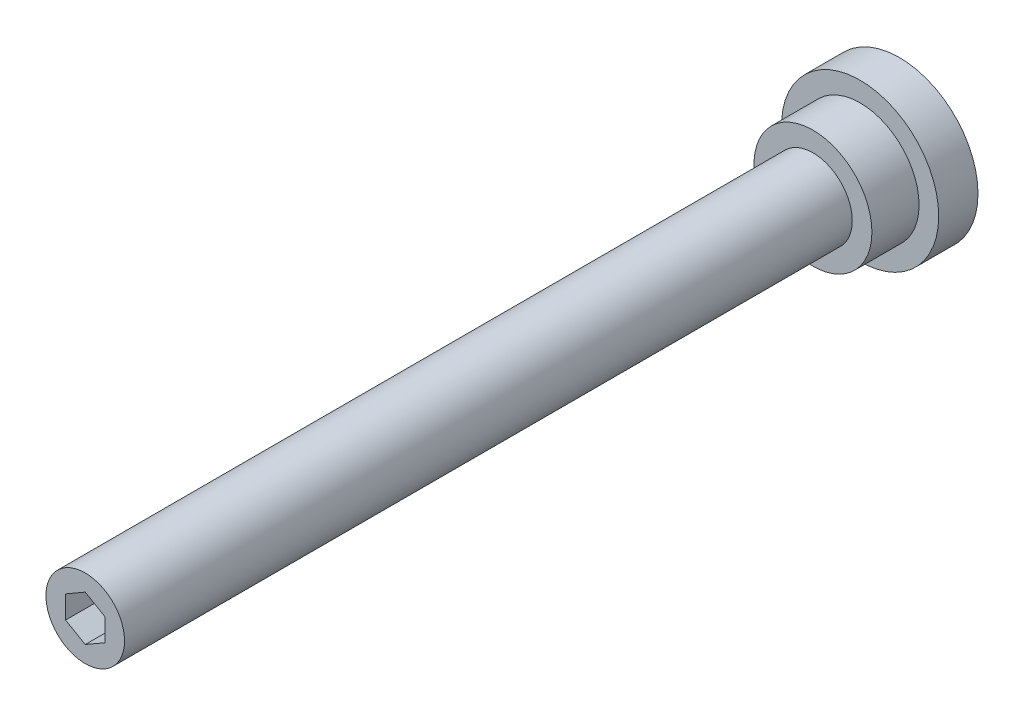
ISO-10303-21;
HEADER;
FILE_DESCRIPTION(('STEP AP214'),'2;1');
FILE_NAME('part.step','',(''),(''),'','','');
FILE_SCHEMA(('AUTOMOTIVE_DESIGN { 1 0 10303 214 1 1 1 1 }'));
ENDSEC;
DATA;
#1=APPLICATION_CONTEXT('core data for automotive mechanical design processes');
#2=APPLICATION_PROTOCOL_DEFINITION('international standard','automotive_design',2000,#1);
#3=PRODUCT_CONTEXT('',#1,'mechanical');
#4=PRODUCT('Part','Part','',(#3));
#5=PRODUCT_RELATED_PRODUCT_CATEGORY('part','',(#4));
#6=PRODUCT_DEFINITION_FORMATION('','',#4);
#7=PRODUCT_DEFINITION_CONTEXT('part definition',#1,'design');
#8=PRODUCT_DEFINITION('design','',#6,#7);
#9=PRODUCT_DEFINITION_SHAPE('','',#8);
#10=(LENGTH_UNIT() NAMED_UNIT(*) SI_UNIT(.MILLI.,.METRE.));
#11=(NAMED_UNIT(*) PLANE_ANGLE_UNIT() SI_UNIT($,.RADIAN.));
#12=(NAMED_UNIT(*) SI_UNIT($,.STERADIAN.) SOLID_ANGLE_UNIT());
#13=UNCERTAINTY_MEASURE_WITH_UNIT(LENGTH_MEASURE(1.E-05),#10,'distance_accuracy_value','');
#14=(GEOMETRIC_REPRESENTATION_CONTEXT(3) GLOBAL_UNCERTAINTY_ASSIGNED_CONTEXT((#13)) GLOBAL_UNIT_ASSIGNED_CONTEXT((#10,
#11,#12)) REPRESENTATION_CONTEXT('',''));
#15=CARTESIAN_POINT('',(0.,0.,0.));
#16=DIRECTION('',(0.,0.,1.));
#17=DIRECTION('',(1.,0.,0.));
#18=AXIS2_PLACEMENT_3D('',#15,#16,#17);
#19=CARTESIAN_POINT('',(0.,0.,103.6));
#20=DIRECTION('',(0.,0.,1.));
#21=DIRECTION('',(1.,0.,0.));
#22=AXIS2_PLACEMENT_3D('',#19,#20,#21);
#23=PLANE('',#22);
#24=DIRECTION('',(-0.866025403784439,0.5,0.));
#25=VECTOR('',#24,1.);
#26=CARTESIAN_POINT('',(2.5,1.44337567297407,103.6));
#27=LINE('',#26,#25);
#28=CARTESIAN_POINT('',(2.5,1.44337567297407,103.6));
#29=VERTEX_POINT('',#28);
#30=CARTESIAN_POINT('',(0.,2.88675134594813,103.6));
#31=VERTEX_POINT('',#30);
#32=EDGE_CURVE('E132',#29,#31,#27,.T.);
#33=ORIENTED_EDGE('',*,*,#32,.F.);
#34=DIRECTION('',(0.,1.,0.));
#35=VECTOR('',#34,1.);
#36=CARTESIAN_POINT('',(2.5,-1.44337567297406,103.6));
#37=LINE('',#36,#35);
#38=CARTESIAN_POINT('',(2.5,-1.44337567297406,103.6));
#39=VERTEX_POINT('',#38);
#40=EDGE_CURVE('E81',#39,#29,#37,.T.);
#41=ORIENTED_EDGE('',*,*,#40,.F.);
#42=DIRECTION('',(0.866025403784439,0.5,0.));
#43=VECTOR('',#42,1.);
#44=CARTESIAN_POINT('',(0.,-2.88675134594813,103.6));
#45=LINE('',#44,#43);
#46=CARTESIAN_POINT('',(0.,-2.88675134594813,103.6));
#47=VERTEX_POINT('',#46);
#48=EDGE_CURVE('E148',#47,#39,#45,.T.);
#49=ORIENTED_EDGE('',*,*,#48,.F.);
#50=DIRECTION('',(0.866025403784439,-0.5,0.));
#51=VECTOR('',#50,1.);
#52=CARTESIAN_POINT('',(-2.5,-1.44337567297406,103.6));
#53=LINE('',#52,#51);
#54=CARTESIAN_POINT('',(-2.5,-1.44337567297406,103.6));
#55=VERTEX_POINT('',#54);
#56=EDGE_CURVE('E146',#55,#47,#53,.T.);
#57=ORIENTED_EDGE('',*,*,#56,.F.);
#58=DIRECTION('',(0.,-1.,0.));
#59=VECTOR('',#58,1.);
#60=CARTESIAN_POINT('',(-2.5,1.44337567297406,103.6));
#61=LINE('',#60,#59);
#62=CARTESIAN_POINT('',(-2.5,1.44337567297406,103.6));
#63=VERTEX_POINT('',#62);
#64=EDGE_CURVE('E138',#63,#55,#61,.T.);
#65=ORIENTED_EDGE('',*,*,#64,.F.);
#66=DIRECTION('',(-0.866025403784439,-0.5,0.));
#67=VECTOR('',#66,1.);
#68=CARTESIAN_POINT('',(0.,2.88675134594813,103.6));
#69=LINE('',#68,#67);
#70=EDGE_CURVE('E136',#31,#63,#69,.T.);
#71=ORIENTED_EDGE('',*,*,#70,.F.);
#72=EDGE_LOOP('',(#33,#41,#49,#57,#65,#71));
#73=FACE_BOUND('',#72,.T.);
#74=CARTESIAN_POINT('',(0.,0.,103.6));
#75=DIRECTION('',(0.,0.,1.));
#76=DIRECTION('',(1.,0.,0.));
#77=AXIS2_PLACEMENT_3D('',#74,#75,#76);
#78=CIRCLE('',#77,5.);
#79=CARTESIAN_POINT('',(5.,0.,103.6));
#80=VERTEX_POINT('',#79);
#81=EDGE_CURVE('E9',#80,#80,#78,.T.);
#82=ORIENTED_EDGE('',*,*,#81,.T.);
#83=EDGE_LOOP('',(#82));
#84=FACE_BOUND('',#83,.T.);
#85=ADVANCED_FACE('F14',(#73,#84),#23,.T.);
#86=CARTESIAN_POINT('',(0.,0.,30.));
#87=DIRECTION('',(0.,0.,1.));
#88=DIRECTION('',(1.,0.,0.));
#89=AXIS2_PLACEMENT_3D('',#86,#87,#88);
#90=CYLINDRICAL_SURFACE('',#89,5.);
#91=CARTESIAN_POINT('',(0.,0.,11.));
#92=DIRECTION('',(0.,0.,1.));
#93=DIRECTION('',(1.,0.,0.));
#94=AXIS2_PLACEMENT_3D('',#91,#92,#93);
#95=CIRCLE('',#94,5.);
#96=CARTESIAN_POINT('',(5.,0.,11.));
#97=VERTEX_POINT('',#96);
#98=EDGE_CURVE('E21',#97,#97,#95,.T.);
#99=ORIENTED_EDGE('',*,*,#98,.T.);
#100=EDGE_LOOP('',(#99));
#101=FACE_BOUND('',#100,.T.);
#102=ORIENTED_EDGE('',*,*,#81,.F.);
#103=EDGE_LOOP('',(#102));
#104=FACE_BOUND('',#103,.T.);
#105=ADVANCED_FACE('F110',(#101,#104),#90,.T.);
#106=CARTESIAN_POINT('',(-5.,0.,11.));
#107=DIRECTION('',(0.,0.,1.));
#108=DIRECTION('',(1.,0.,0.));
#109=AXIS2_PLACEMENT_3D('',#106,#107,#108);
#110=PLANE('',#109);
#111=CARTESIAN_POINT('',(0.,0.,11.));
#112=DIRECTION('',(0.,0.,1.));
#113=DIRECTION('',(1.,0.,0.));
#114=AXIS2_PLACEMENT_3D('',#111,#112,#113);
#115=CIRCLE('',#114,7.5);
#116=CARTESIAN_POINT('',(7.5,0.,11.));
#117=VERTEX_POINT('',#116);
#118=EDGE_CURVE('E105',#117,#117,#115,.T.);
#119=ORIENTED_EDGE('',*,*,#118,.T.);
#120=EDGE_LOOP('',(#119));
#121=FACE_BOUND('',#120,.T.);
#122=ORIENTED_EDGE('',*,*,#98,.F.);
#123=EDGE_LOOP('',(#122));
#124=FACE_BOUND('',#123,.T.);
#125=ADVANCED_FACE('F113',(#121,#124),#110,.T.);
#126=CARTESIAN_POINT('',(0.,0.,30.));
#127=DIRECTION('',(0.,0.,1.));
#128=DIRECTION('',(1.,0.,0.));
#129=AXIS2_PLACEMENT_3D('',#126,#127,#128);
#130=CYLINDRICAL_SURFACE('',#129,7.5);
#131=CARTESIAN_POINT('',(0.,0.,5.));
#132=DIRECTION('',(0.,0.,1.));
#133=DIRECTION('',(1.,0.,0.));
#134=AXIS2_PLACEMENT_3D('',#131,#132,#133);
#135=CIRCLE('',#134,7.5);
#136=CARTESIAN_POINT('',(7.5,0.,5.));
#137=VERTEX_POINT('',#136);
#138=EDGE_CURVE('E102',#137,#137,#135,.T.);
#139=ORIENTED_EDGE('',*,*,#138,.T.);
#140=EDGE_LOOP('',(#139));
#141=FACE_BOUND('',#140,.T.);
#142=ORIENTED_EDGE('',*,*,#118,.F.);
#143=EDGE_LOOP('',(#142));
#144=FACE_BOUND('',#143,.T.);
#145=ADVANCED_FACE('F115',(#141,#144),#130,.T.);
#146=CARTESIAN_POINT('',(-7.5,0.,5.));
#147=DIRECTION('',(0.,0.,1.));
#148=DIRECTION('',(1.,0.,0.));
#149=AXIS2_PLACEMENT_3D('',#146,#147,#148);
#150=PLANE('',#149);
#151=CARTESIAN_POINT('',(0.,0.,5.));
#152=DIRECTION('',(0.,0.,1.));
#153=DIRECTION('',(1.,0.,0.));
#154=AXIS2_PLACEMENT_3D('',#151,#152,#153);
#155=CIRCLE('',#154,10.);
#156=CARTESIAN_POINT('',(10.,0.,5.));
#157=VERTEX_POINT('',#156);
#158=EDGE_CURVE('E87',#157,#157,#155,.T.);
#159=ORIENTED_EDGE('',*,*,#158,.T.);
#160=EDGE_LOOP('',(#159));
#161=FACE_BOUND('',#160,.T.);
#162=ORIENTED_EDGE('',*,*,#138,.F.);
#163=EDGE_LOOP('',(#162));
#164=FACE_BOUND('',#163,.T.);
#165=ADVANCED_FACE('F123',(#161,#164),#150,.T.);
#166=CARTESIAN_POINT('',(0.,0.,30.));
#167=DIRECTION('',(0.,0.,1.));
#168=DIRECTION('',(1.,0.,0.));
#169=AXIS2_PLACEMENT_3D('',#166,#167,#168);
#170=CYLINDRICAL_SURFACE('',#169,10.);
#171=CARTESIAN_POINT('',(0.,0.,0.));
#172=DIRECTION('',(0.,0.,1.));
#173=DIRECTION('',(1.,0.,0.));
#174=AXIS2_PLACEMENT_3D('',#171,#172,#173);
#175=CIRCLE('',#174,10.);
#176=CARTESIAN_POINT('',(10.,0.,0.));
#177=VERTEX_POINT('',#176);
#178=EDGE_CURVE('E83',#177,#177,#175,.T.);
#179=ORIENTED_EDGE('',*,*,#178,.T.);
#180=EDGE_LOOP('',(#179));
#181=FACE_BOUND('',#180,.T.);
#182=ORIENTED_EDGE('',*,*,#158,.F.);
#183=EDGE_LOOP('',(#182));
#184=FACE_BOUND('',#183,.T.);
#185=ADVANCED_FACE('F179',(#181,#184),#170,.T.);
#186=CARTESIAN_POINT('',(-10.,0.,0.));
#187=DIRECTION('',(0.,0.,-1.));
#188=DIRECTION('',(-1.,0.,0.));
#189=AXIS2_PLACEMENT_3D('',#186,#187,#188);
#190=PLANE('',#189);
#191=ORIENTED_EDGE('',*,*,#178,.F.);
#192=EDGE_LOOP('',(#191));
#193=FACE_BOUND('',#192,.T.);
#194=ADVANCED_FACE('F176',(#193),#190,.T.);
#195=CARTESIAN_POINT('',(2.5,1.44337567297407,98.6));
#196=DIRECTION('',(0.5,0.866025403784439,0.));
#197=DIRECTION('',(-0.866025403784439,0.5,0.));
#198=AXIS2_PLACEMENT_3D('',#195,#196,#197);
#199=PLANE('',#198);
#200=DIRECTION('',(0.,0.,1.));
#201=VECTOR('',#200,1.);
#202=CARTESIAN_POINT('',(0.,2.88675134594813,98.6));
#203=LINE('',#202,#201);
#204=CARTESIAN_POINT('',(0.,2.88675134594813,99.6));
#205=VERTEX_POINT('',#204);
#206=EDGE_CURVE('E35',#205,#31,#203,.T.);
#207=ORIENTED_EDGE('',*,*,#206,.F.);
#208=DIRECTION('',(-0.866025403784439,0.5,0.));
#209=VECTOR('',#208,1.);
#210=CARTESIAN_POINT('',(2.5,1.44337567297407,99.6));
#211=LINE('',#210,#209);
#212=CARTESIAN_POINT('',(2.5,1.44337567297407,99.6));
#213=VERTEX_POINT('',#212);
#214=EDGE_CURVE('E28',#213,#205,#211,.T.);
#215=ORIENTED_EDGE('',*,*,#214,.F.);
#216=DIRECTION('',(0.,0.,1.));
#217=VECTOR('',#216,1.);
#218=CARTESIAN_POINT('',(2.5,1.44337567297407,98.6));
#219=LINE('',#218,#217);
#220=EDGE_CURVE('E75',#213,#29,#219,.T.);
#221=ORIENTED_EDGE('',*,*,#220,.T.);
#222=ORIENTED_EDGE('',*,*,#32,.T.);
#223=EDGE_LOOP('',(#207,#215,#221,#222));
#224=FACE_BOUND('',#223,.T.);
#225=ADVANCED_FACE('F74',(#224),#199,.F.);
#226=CARTESIAN_POINT('',(2.5,-1.44337567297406,98.6));
#227=DIRECTION('',(1.,0.,0.));
#228=DIRECTION('',(0.,1.,0.));
#229=AXIS2_PLACEMENT_3D('',#226,#227,#228);
#230=PLANE('',#229);
#231=ORIENTED_EDGE('',*,*,#220,.F.);
#232=DIRECTION('',(0.,1.,0.));
#233=VECTOR('',#232,1.);
#234=CARTESIAN_POINT('',(2.5,-1.44337567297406,99.6));
#235=LINE('',#234,#233);
#236=CARTESIAN_POINT('',(2.5,-1.44337567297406,99.6));
#237=VERTEX_POINT('',#236);
#238=EDGE_CURVE('E65',#237,#213,#235,.T.);
#239=ORIENTED_EDGE('',*,*,#238,.F.);
#240=DIRECTION('',(0.,0.,1.));
#241=VECTOR('',#240,1.);
#242=CARTESIAN_POINT('',(2.5,-1.44337567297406,98.6));
#243=LINE('',#242,#241);
#244=EDGE_CURVE('E84',#237,#39,#243,.T.);
#245=ORIENTED_EDGE('',*,*,#244,.T.);
#246=ORIENTED_EDGE('',*,*,#40,.T.);
#247=EDGE_LOOP('',(#231,#239,#245,#246));
#248=FACE_BOUND('',#247,.T.);
#249=ADVANCED_FACE('F79',(#248),#230,.F.);
#250=CARTESIAN_POINT('',(0.,-2.88675134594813,98.6));
#251=DIRECTION('',(0.5,-0.866025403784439,0.));
#252=DIRECTION('',(0.866025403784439,0.5,0.));
#253=AXIS2_PLACEMENT_3D('',#250,#251,#252);
#254=PLANE('',#253);
#255=ORIENTED_EDGE('',*,*,#244,.F.);
#256=DIRECTION('',(0.866025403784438,0.5,0.));
#257=VECTOR('',#256,1.);
#258=CARTESIAN_POINT('',(0.,-2.88675134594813,99.6));
#259=LINE('',#258,#257);
#260=CARTESIAN_POINT('',(0.,-2.88675134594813,99.6));
#261=VERTEX_POINT('',#260);
#262=EDGE_CURVE('E68',#261,#237,#259,.T.);
#263=ORIENTED_EDGE('',*,*,#262,.F.);
#264=DIRECTION('',(0.,0.,1.));
#265=VECTOR('',#264,1.);
#266=CARTESIAN_POINT('',(0.,-2.88675134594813,98.6));
#267=LINE('',#266,#265);
#268=EDGE_CURVE('E89',#261,#47,#267,.T.);
#269=ORIENTED_EDGE('',*,*,#268,.T.);
#270=ORIENTED_EDGE('',*,*,#48,.T.);
#271=EDGE_LOOP('',(#255,#263,#269,#270));
#272=FACE_BOUND('',#271,.T.);
#273=ADVANCED_FACE('F151',(#272),#254,.F.);
#274=CARTESIAN_POINT('',(-2.5,-1.44337567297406,98.6));
#275=DIRECTION('',(-0.5,-0.866025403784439,0.));
#276=DIRECTION('',(0.866025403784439,-0.5,0.));
#277=AXIS2_PLACEMENT_3D('',#274,#275,#276);
#278=PLANE('',#277);
#279=ORIENTED_EDGE('',*,*,#268,.F.);
#280=DIRECTION('',(0.866025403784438,-0.5,0.));
#281=VECTOR('',#280,1.);
#282=CARTESIAN_POINT('',(-2.5,-1.44337567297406,99.6));
#283=LINE('',#282,#281);
#284=CARTESIAN_POINT('',(-2.5,-1.44337567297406,99.6));
#285=VERTEX_POINT('',#284);
#286=EDGE_CURVE('E140',#285,#261,#283,.T.);
#287=ORIENTED_EDGE('',*,*,#286,.F.);
#288=DIRECTION('',(0.,0.,1.));
#289=VECTOR('',#288,1.);
#290=CARTESIAN_POINT('',(-2.5,-1.44337567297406,98.6));
#291=LINE('',#290,#289);
#292=EDGE_CURVE('E95',#285,#55,#291,.T.);
#293=ORIENTED_EDGE('',*,*,#292,.T.);
#294=ORIENTED_EDGE('',*,*,#56,.T.);
#295=EDGE_LOOP('',(#279,#287,#293,#294));
#296=FACE_BOUND('',#295,.T.);
#297=ADVANCED_FACE('F155',(#296),#278,.F.);
#298=CARTESIAN_POINT('',(-2.5,1.44337567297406,98.6));
#299=DIRECTION('',(-1.,0.,0.));
#300=DIRECTION('',(0.,-1.,0.));
#301=AXIS2_PLACEMENT_3D('',#298,#299,#300);
#302=PLANE('',#301);
#303=ORIENTED_EDGE('',*,*,#292,.F.);
#304=DIRECTION('',(0.,-1.,0.));
#305=VECTOR('',#304,1.);
#306=CARTESIAN_POINT('',(-2.5,1.44337567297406,99.6));
#307=LINE('',#306,#305);
#308=CARTESIAN_POINT('',(-2.5,1.44337567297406,99.6));
#309=VERTEX_POINT('',#308);
#310=EDGE_CURVE('E162',#309,#285,#307,.T.);
#311=ORIENTED_EDGE('',*,*,#310,.F.);
#312=DIRECTION('',(0.,0.,1.));
#313=VECTOR('',#312,1.);
#314=CARTESIAN_POINT('',(-2.5,1.44337567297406,98.6));
#315=LINE('',#314,#313);
#316=EDGE_CURVE('E97',#309,#63,#315,.T.);
#317=ORIENTED_EDGE('',*,*,#316,.T.);
#318=ORIENTED_EDGE('',*,*,#64,.T.);
#319=EDGE_LOOP('',(#303,#311,#317,#318));
#320=FACE_BOUND('',#319,.T.);
#321=ADVANCED_FACE('F160',(#320),#302,.F.);
#322=CARTESIAN_POINT('',(0.,2.88675134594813,98.6));
#323=DIRECTION('',(-0.5,0.866025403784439,0.));
#324=DIRECTION('',(-0.866025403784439,-0.5,0.));
#325=AXIS2_PLACEMENT_3D('',#322,#323,#324);
#326=PLANE('',#325);
#327=ORIENTED_EDGE('',*,*,#316,.F.);
#328=DIRECTION('',(-0.866025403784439,-0.5,0.));
#329=VECTOR('',#328,1.);
#330=CARTESIAN_POINT('',(0.,2.88675134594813,99.6));
#331=LINE('',#330,#329);
#332=EDGE_CURVE('E77',#205,#309,#331,.T.);
#333=ORIENTED_EDGE('',*,*,#332,.F.);
#334=ORIENTED_EDGE('',*,*,#206,.T.);
#335=ORIENTED_EDGE('',*,*,#70,.T.);
#336=EDGE_LOOP('',(#327,#333,#334,#335));
#337=FACE_BOUND('',#336,.T.);
#338=ADVANCED_FACE('F163',(#337),#326,.F.);
#339=CARTESIAN_POINT('',(2.5,1.44337567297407,99.6));
#340=DIRECTION('',(0.,0.,1.));
#341=DIRECTION('',(1.,0.,0.));
#342=AXIS2_PLACEMENT_3D('',#339,#340,#341);
#343=PLANE('',#342);
#344=ORIENTED_EDGE('',*,*,#238,.T.);
#345=ORIENTED_EDGE('',*,*,#214,.T.);
#346=ORIENTED_EDGE('',*,*,#332,.T.);
#347=ORIENTED_EDGE('',*,*,#310,.T.);
#348=ORIENTED_EDGE('',*,*,#286,.T.);
#349=ORIENTED_EDGE('',*,*,#262,.T.);
#350=EDGE_LOOP('',(#344,#345,#346,#347,#348,#349));
#351=FACE_BOUND('',#350,.T.);
#352=ADVANCED_FACE('F66',(#351),#343,.T.);
#353=CLOSED_SHELL('',(#85,#105,#125,#145,#165,#185,#194,#225,#249,#273,#297,#321,#338,#352));
#354=MANIFOLD_SOLID_BREP('B1',#353);
#355=ADVANCED_BREP_SHAPE_REPRESENTATION('',(#18,#354),#14);
#356=SHAPE_DEFINITION_REPRESENTATION(#9,#355);
ENDSEC;
END-ISO-10303-21;
